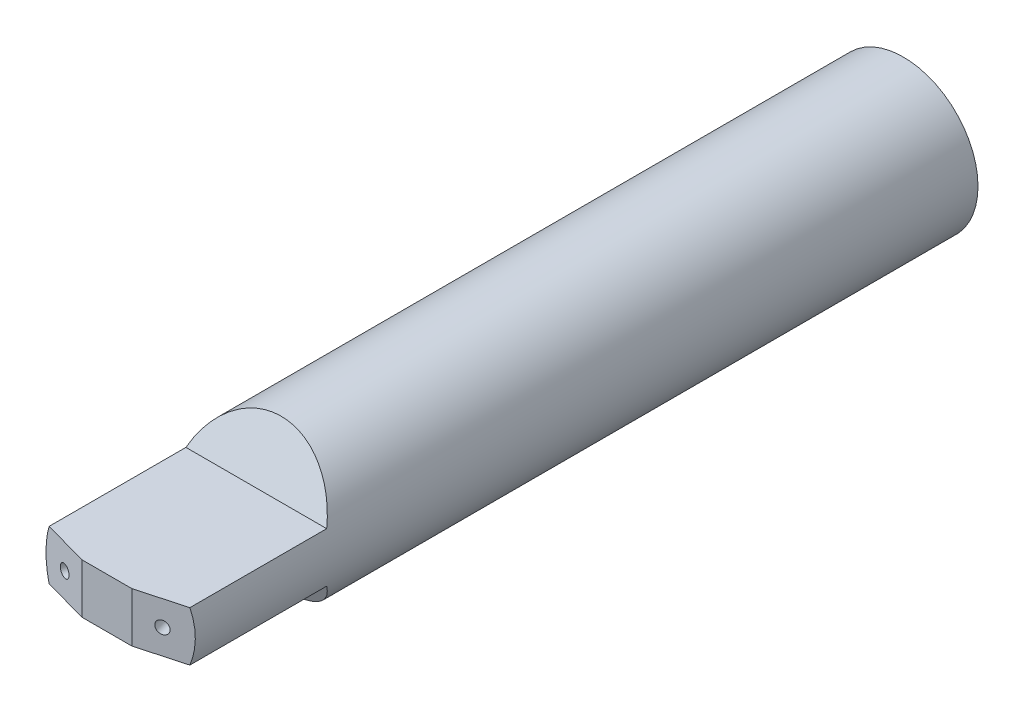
from build123d import *

# Parameters (mm, degrees)
ESQUISSE1_R                  = 3
EXTRUSION1_DEPTH             = 32
ENL_V_MAT_EXTRU_1_DEPTH      = 33.280024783
ENL_V_MAT_EXTRU_1_DEPTH_BACK = 33.280024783
ENL_V_MAT_EXTRU_2_DEPTH      = 33.280024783
ENL_V_MAT_EXTRU_2_DEPTH_BACK = 33.280024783
ESQUISSE4_R                  = 0.25
ENL_V_MAT_EXTRU_3_DEPTH      = 5
ESQUISSE5_R                  = 0.25
ENL_V_MAT_EXTRU_4_DEPTH      = 5


with BuildPart() as part:
    # Esquisse1 → Extrusion1 (new body)
    with BuildSketch(Plane.XY):
        Circle(ESQUISSE1_R)
    extrude(amount=EXTRUSION1_DEPTH)

    # Esquisse2 → Enl_v. mat.-Extru.1 (cut, two sides: drawn at the far end of the back side and taken through both)
    with BuildSketch(Plane(origin=(0, 0, 0), x_dir=(0, 0, -1), z_dir=(1, 0, 0)).offset(-ENL_V_MAT_EXTRU_1_DEPTH_BACK)):
        Polygon((-32, 3), (-26, 3), (-25, 3), (-26, 1), (-32, 1), align=None)
        Polygon((-32, -3), (-26, -3), (-25, -3), (-26, -1), (-32, -1), align=None)
    extrude(amount=ENL_V_MAT_EXTRU_1_DEPTH + ENL_V_MAT_EXTRU_1_DEPTH_BACK, mode=Mode.SUBTRACT)

    # Esquisse3 → Enl_v. mat.-Extru.2 (cut, two sides: drawn at the far end of the back side and taken through both)
    with BuildSketch(Plane(origin=(0, 0, 0), x_dir=(1, 0, 0), z_dir=(0, 1, 0)).offset(-ENL_V_MAT_EXTRU_2_DEPTH_BACK)):
        Polygon((1, -32), (3, -31.45), (3.307059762, -31.45), (3.307059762, -32.884515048), (-3.44220005, -32.884515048), (-3.44220005, -31.45), (-3, -31.45), (-1, -32), (-1, -32.428320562), (1, -32.428320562), align=None)
    extrude(amount=ENL_V_MAT_EXTRU_2_DEPTH + ENL_V_MAT_EXTRU_2_DEPTH_BACK, mode=Mode.SUBTRACT)

    # Esquisse4 → Enl_v. mat.-Extru.3 (cut)
    with BuildSketch(Plane(origin=(-8.251597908, 0, 30.005810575), x_dir=(0.9642053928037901, 0, 0.2651564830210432), z_dir=(-0.2651564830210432, 0, 0.9642053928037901))):
        with Locations((6.520802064, 0)):
            Circle(ESQUISSE4_R)
    extrude(amount=-ENL_V_MAT_EXTRU_3_DEPTH, mode=Mode.SUBTRACT)

    # Esquisse5 → Enl_v. mat.-Extru.4 (cut)
    with BuildSketch(Plane(origin=(8.251597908, 0, 30.005810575), x_dir=(0.9642053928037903, 0, -0.2651564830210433), z_dir=(0.2651564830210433, 0, 0.9642053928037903))):
        with Locations((-6.520802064, 0)):
            Circle(ESQUISSE5_R)
    extrude(amount=-ENL_V_MAT_EXTRU_4_DEPTH, mode=Mode.SUBTRACT)


solid = part.part
